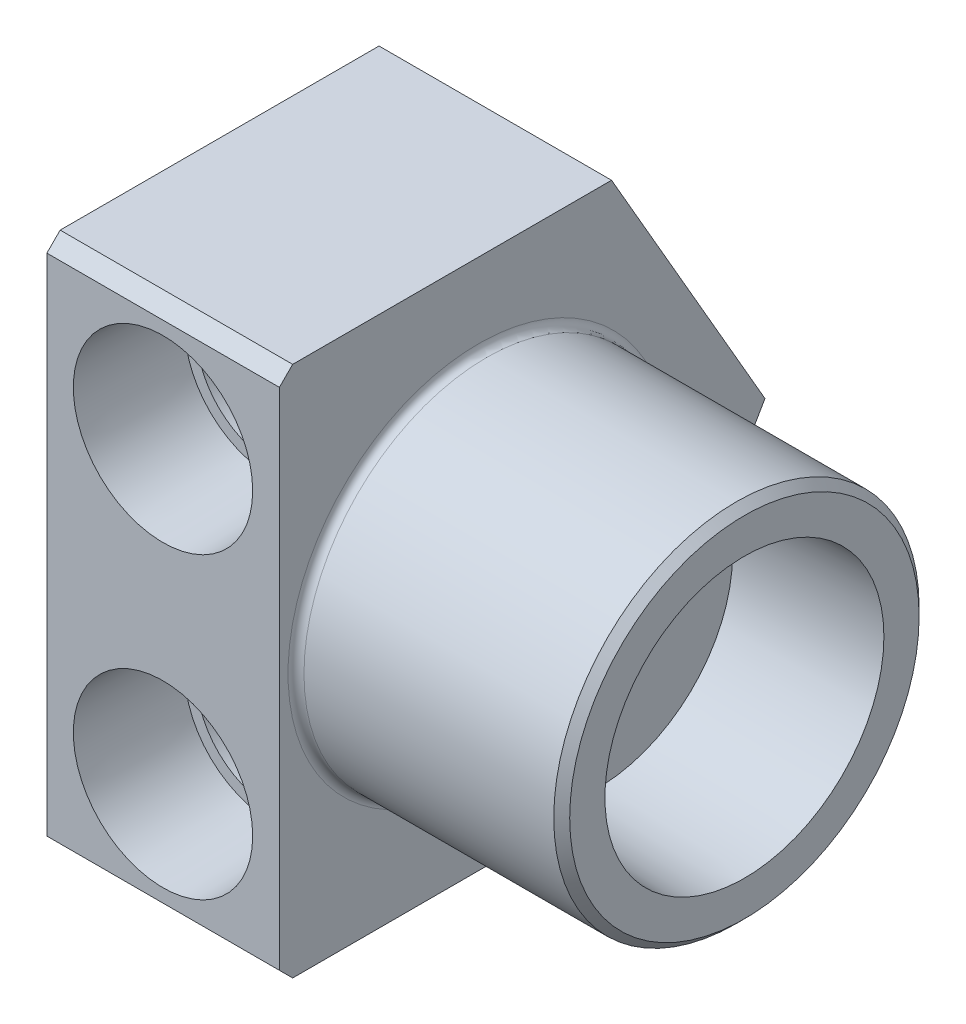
ISO-10303-21;
HEADER;
FILE_DESCRIPTION(('STEP AP214'),'2;1');
FILE_NAME('part.step','',(''),(''),'','','');
FILE_SCHEMA(('AUTOMOTIVE_DESIGN { 1 0 10303 214 1 1 1 1 }'));
ENDSEC;
DATA;
#1=APPLICATION_CONTEXT('core data for automotive mechanical design processes');
#2=APPLICATION_PROTOCOL_DEFINITION('international standard','automotive_design',2000,#1);
#3=PRODUCT_CONTEXT('',#1,'mechanical');
#4=PRODUCT('Part','Part','',(#3));
#5=PRODUCT_RELATED_PRODUCT_CATEGORY('part','',(#4));
#6=PRODUCT_DEFINITION_FORMATION('','',#4);
#7=PRODUCT_DEFINITION_CONTEXT('part definition',#1,'design');
#8=PRODUCT_DEFINITION('design','',#6,#7);
#9=PRODUCT_DEFINITION_SHAPE('','',#8);
#10=(LENGTH_UNIT() NAMED_UNIT(*) SI_UNIT(.MILLI.,.METRE.));
#11=(NAMED_UNIT(*) PLANE_ANGLE_UNIT() SI_UNIT($,.RADIAN.));
#12=(NAMED_UNIT(*) SI_UNIT($,.STERADIAN.) SOLID_ANGLE_UNIT());
#13=UNCERTAINTY_MEASURE_WITH_UNIT(LENGTH_MEASURE(1.E-05),#10,'distance_accuracy_value','');
#14=(GEOMETRIC_REPRESENTATION_CONTEXT(3) GLOBAL_UNCERTAINTY_ASSIGNED_CONTEXT((#13)) GLOBAL_UNIT_ASSIGNED_CONTEXT((#10,
#11,#12)) REPRESENTATION_CONTEXT('',''));
#15=CARTESIAN_POINT('',(0.,0.,0.));
#16=DIRECTION('',(0.,0.,1.));
#17=DIRECTION('',(1.,0.,0.));
#18=AXIS2_PLACEMENT_3D('',#15,#16,#17);
#19=CARTESIAN_POINT('',(33.5788,6.477,0.));
#20=DIRECTION('',(-1.,0.,0.));
#21=DIRECTION('',(0.,0.,1.));
#22=AXIS2_PLACEMENT_3D('',#19,#20,#21);
#23=PLANE('',#22);
#24=CARTESIAN_POINT('',(33.5788,0.,0.));
#25=DIRECTION('',(1.,0.,0.));
#26=DIRECTION('',(0.,0.,-1.));
#27=AXIS2_PLACEMENT_3D('',#24,#25,#26);
#28=CIRCLE('',#27,12.9142093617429);
#29=CARTESIAN_POINT('',(33.5788,0.,-12.9142093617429));
#30=VERTEX_POINT('',#29);
#31=EDGE_CURVE('E125',#30,#30,#28,.T.);
#32=ORIENTED_EDGE('',*,*,#31,.T.);
#33=EDGE_LOOP('',(#32));
#34=FACE_BOUND('',#33,.T.);
#35=CARTESIAN_POINT('',(33.5788,0.,0.));
#36=DIRECTION('',(1.,0.,0.));
#37=DIRECTION('',(0.,0.,-1.));
#38=AXIS2_PLACEMENT_3D('',#35,#36,#37);
#39=CIRCLE('',#38,6.54812);
#40=CARTESIAN_POINT('',(33.5788,0.,-6.54812));
#41=VERTEX_POINT('',#40);
#42=EDGE_CURVE('E94',#41,#41,#39,.T.);
#43=ORIENTED_EDGE('',*,*,#42,.F.);
#44=EDGE_LOOP('',(#43));
#45=FACE_BOUND('',#44,.T.);
#46=ADVANCED_FACE('F15',(#34,#45),#23,.F.);
#47=CARTESIAN_POINT('',(22.225,25.4,-12.7));
#48=DIRECTION('',(0.,-1.,0.));
#49=DIRECTION('',(0.,0.,-1.));
#50=AXIS2_PLACEMENT_3D('',#47,#48,#49);
#51=PLANE('',#50);
#52=DIRECTION('',(0.,0.,1.));
#53=VECTOR('',#52,1.);
#54=CARTESIAN_POINT('',(0.,25.4,-12.7));
#55=LINE('',#54,#53);
#56=CARTESIAN_POINT('',(0.,25.4,-12.7));
#57=VERTEX_POINT('',#56);
#58=CARTESIAN_POINT('',(0.,25.4,17.78));
#59=VERTEX_POINT('',#58);
#60=EDGE_CURVE('E128',#57,#59,#55,.T.);
#61=ORIENTED_EDGE('',*,*,#60,.T.);
#62=DIRECTION('',(1.,0.,0.));
#63=VECTOR('',#62,1.);
#64=CARTESIAN_POINT('',(22.225,25.4,17.78));
#65=LINE('',#64,#63);
#66=CARTESIAN_POINT('',(22.225,25.4,17.78));
#67=VERTEX_POINT('',#66);
#68=EDGE_CURVE('E10',#59,#67,#65,.T.);
#69=ORIENTED_EDGE('',*,*,#68,.T.);
#70=DIRECTION('',(0.,0.,1.));
#71=VECTOR('',#70,1.);
#72=CARTESIAN_POINT('',(22.225,25.4,-12.7));
#73=LINE('',#72,#71);
#74=CARTESIAN_POINT('',(22.225,25.4,-12.7));
#75=VERTEX_POINT('',#74);
#76=EDGE_CURVE('E129',#75,#67,#73,.T.);
#77=ORIENTED_EDGE('',*,*,#76,.F.);
#78=DIRECTION('',(-1.,0.,0.));
#79=VECTOR('',#78,1.);
#80=CARTESIAN_POINT('',(22.225,25.4,-12.7));
#81=LINE('',#80,#79);
#82=EDGE_CURVE('E140',#75,#57,#81,.T.);
#83=ORIENTED_EDGE('',*,*,#82,.T.);
#84=EDGE_LOOP('',(#61,#69,#77,#83));
#85=FACE_BOUND('',#84,.T.);
#86=ADVANCED_FACE('F203',(#85),#51,.F.);
#87=CARTESIAN_POINT('',(22.225,25.4,19.05));
#88=DIRECTION('',(0.,0.,-1.));
#89=DIRECTION('',(-1.,0.,0.));
#90=AXIS2_PLACEMENT_3D('',#87,#88,#89);
#91=PLANE('',#90);
#92=CARTESIAN_POINT('',(11.0998,14.2875,19.05));
#93=DIRECTION('',(0.,0.,1.));
#94=DIRECTION('',(1.,0.,0.));
#95=AXIS2_PLACEMENT_3D('',#92,#93,#94);
#96=CIRCLE('',#95,8.5727286);
#97=CARTESIAN_POINT('',(19.6725286,14.2875,19.05));
#98=VERTEX_POINT('',#97);
#99=EDGE_CURVE('E93',#98,#98,#96,.T.);
#100=ORIENTED_EDGE('',*,*,#99,.F.);
#101=EDGE_LOOP('',(#100));
#102=FACE_BOUND('',#101,.T.);
#103=CARTESIAN_POINT('',(11.0998,-14.2875,19.05));
#104=DIRECTION('',(0.,0.,1.));
#105=DIRECTION('',(1.,0.,0.));
#106=AXIS2_PLACEMENT_3D('',#103,#104,#105);
#107=CIRCLE('',#106,8.5727286);
#108=CARTESIAN_POINT('',(19.6725286,-14.2875,19.05));
#109=VERTEX_POINT('',#108);
#110=EDGE_CURVE('E110',#109,#109,#107,.T.);
#111=ORIENTED_EDGE('',*,*,#110,.F.);
#112=EDGE_LOOP('',(#111));
#113=FACE_BOUND('',#112,.T.);
#114=DIRECTION('',(0.,-1.,0.));
#115=VECTOR('',#114,1.);
#116=CARTESIAN_POINT('',(0.,25.4,19.05));
#117=LINE('',#116,#115);
#118=CARTESIAN_POINT('',(0.,24.13,19.05));
#119=VERTEX_POINT('',#118);
#120=CARTESIAN_POINT('',(0.,-24.13,19.05));
#121=VERTEX_POINT('',#120);
#122=EDGE_CURVE('E142',#119,#121,#117,.T.);
#123=ORIENTED_EDGE('',*,*,#122,.T.);
#124=DIRECTION('',(1.,0.,0.));
#125=VECTOR('',#124,1.);
#126=CARTESIAN_POINT('',(22.225,-24.13,19.05));
#127=LINE('',#126,#125);
#128=CARTESIAN_POINT('',(22.225,-24.13,19.05));
#129=VERTEX_POINT('',#128);
#130=EDGE_CURVE('E36',#121,#129,#127,.T.);
#131=ORIENTED_EDGE('',*,*,#130,.T.);
#132=DIRECTION('',(0.,-1.,0.));
#133=VECTOR('',#132,1.);
#134=CARTESIAN_POINT('',(22.225,25.4,19.05));
#135=LINE('',#134,#133);
#136=CARTESIAN_POINT('',(22.225,24.13,19.05));
#137=VERTEX_POINT('',#136);
#138=EDGE_CURVE('E131',#137,#129,#135,.T.);
#139=ORIENTED_EDGE('',*,*,#138,.F.);
#140=DIRECTION('',(-1.,0.,0.));
#141=VECTOR('',#140,1.);
#142=CARTESIAN_POINT('',(22.225,24.13,19.05));
#143=LINE('',#142,#141);
#144=EDGE_CURVE('E176',#137,#119,#143,.T.);
#145=ORIENTED_EDGE('',*,*,#144,.T.);
#146=EDGE_LOOP('',(#123,#131,#139,#145));
#147=FACE_BOUND('',#146,.T.);
#148=ADVANCED_FACE('F197',(#102,#113,#147),#91,.F.);
#149=CARTESIAN_POINT('',(22.225,-25.4,19.05));
#150=DIRECTION('',(0.,1.,0.));
#151=DIRECTION('',(0.,0.,1.));
#152=AXIS2_PLACEMENT_3D('',#149,#150,#151);
#153=PLANE('',#152);
#154=DIRECTION('',(0.,0.,-1.));
#155=VECTOR('',#154,1.);
#156=CARTESIAN_POINT('',(22.225,-25.4,19.05));
#157=LINE('',#156,#155);
#158=CARTESIAN_POINT('',(22.225,-25.4,17.78));
#159=VERTEX_POINT('',#158);
#160=CARTESIAN_POINT('',(22.225,-25.4,-12.7));
#161=VERTEX_POINT('',#160);
#162=EDGE_CURVE('E134',#159,#161,#157,.T.);
#163=ORIENTED_EDGE('',*,*,#162,.F.);
#164=DIRECTION('',(-1.,0.,0.));
#165=VECTOR('',#164,1.);
#166=CARTESIAN_POINT('',(22.225,-25.4,17.78));
#167=LINE('',#166,#165);
#168=CARTESIAN_POINT('',(0.,-25.4,17.78));
#169=VERTEX_POINT('',#168);
#170=EDGE_CURVE('E169',#159,#169,#167,.T.);
#171=ORIENTED_EDGE('',*,*,#170,.T.);
#172=DIRECTION('',(0.,0.,-1.));
#173=VECTOR('',#172,1.);
#174=CARTESIAN_POINT('',(0.,-25.4,19.05));
#175=LINE('',#174,#173);
#176=CARTESIAN_POINT('',(0.,-25.4,-12.7));
#177=VERTEX_POINT('',#176);
#178=EDGE_CURVE('E144',#169,#177,#175,.T.);
#179=ORIENTED_EDGE('',*,*,#178,.T.);
#180=DIRECTION('',(-1.,0.,0.));
#181=VECTOR('',#180,1.);
#182=CARTESIAN_POINT('',(22.225,-25.4,-12.7));
#183=LINE('',#182,#181);
#184=EDGE_CURVE('E154',#161,#177,#183,.T.);
#185=ORIENTED_EDGE('',*,*,#184,.F.);
#186=EDGE_LOOP('',(#163,#171,#179,#185));
#187=FACE_BOUND('',#186,.T.);
#188=ADVANCED_FACE('F189',(#187),#153,.F.);
#189=CARTESIAN_POINT('',(22.225,-25.4,-12.7));
#190=DIRECTION('',(0.,0.5,0.866025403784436));
#191=DIRECTION('',(0.,-0.866025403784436,0.5));
#192=AXIS2_PLACEMENT_3D('',#189,#190,#191);
#193=PLANE('',#192);
#194=DIRECTION('',(0.,0.866025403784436,-0.5));
#195=VECTOR('',#194,1.);
#196=CARTESIAN_POINT('',(0.,-25.4,-12.7));
#197=LINE('',#196,#195);
#198=CARTESIAN_POINT('',(0.,0.,-27.3646968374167));
#199=VERTEX_POINT('',#198);
#200=EDGE_CURVE('E146',#177,#199,#197,.T.);
#201=ORIENTED_EDGE('',*,*,#200,.T.);
#202=DIRECTION('',(-1.,0.,0.));
#203=VECTOR('',#202,1.);
#204=CARTESIAN_POINT('',(22.225,0.,-27.3646968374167));
#205=LINE('',#204,#203);
#206=CARTESIAN_POINT('',(22.225,0.,-27.3646968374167));
#207=VERTEX_POINT('',#206);
#208=EDGE_CURVE('E151',#207,#199,#205,.T.);
#209=ORIENTED_EDGE('',*,*,#208,.F.);
#210=DIRECTION('',(0.,0.866025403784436,-0.5));
#211=VECTOR('',#210,1.);
#212=CARTESIAN_POINT('',(22.225,-25.4,-12.7));
#213=LINE('',#212,#211);
#214=EDGE_CURVE('E136',#161,#207,#213,.T.);
#215=ORIENTED_EDGE('',*,*,#214,.F.);
#216=ORIENTED_EDGE('',*,*,#184,.T.);
#217=EDGE_LOOP('',(#201,#209,#215,#216));
#218=FACE_BOUND('',#217,.T.);
#219=ADVANCED_FACE('F210',(#218),#193,.F.);
#220=CARTESIAN_POINT('',(22.225,0.,-27.3646968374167));
#221=DIRECTION('',(0.,-0.5,0.866025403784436));
#222=DIRECTION('',(0.,-0.866025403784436,-0.5));
#223=AXIS2_PLACEMENT_3D('',#220,#221,#222);
#224=PLANE('',#223);
#225=DIRECTION('',(0.,0.866025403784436,0.5));
#226=VECTOR('',#225,1.);
#227=CARTESIAN_POINT('',(0.,0.,-27.3646968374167));
#228=LINE('',#227,#226);
#229=EDGE_CURVE('E132',#199,#57,#228,.T.);
#230=ORIENTED_EDGE('',*,*,#229,.T.);
#231=ORIENTED_EDGE('',*,*,#82,.F.);
#232=DIRECTION('',(0.,0.866025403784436,0.5));
#233=VECTOR('',#232,1.);
#234=CARTESIAN_POINT('',(22.225,0.,-27.3646968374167));
#235=LINE('',#234,#233);
#236=EDGE_CURVE('E138',#207,#75,#235,.T.);
#237=ORIENTED_EDGE('',*,*,#236,.F.);
#238=ORIENTED_EDGE('',*,*,#208,.T.);
#239=EDGE_LOOP('',(#230,#231,#237,#238));
#240=FACE_BOUND('',#239,.T.);
#241=ADVANCED_FACE('F207',(#240),#224,.F.);
#242=CARTESIAN_POINT('',(22.225,0.,0.));
#243=DIRECTION('',(1.,0.,0.));
#244=DIRECTION('',(0.,0.,-1.));
#245=AXIS2_PLACEMENT_3D('',#242,#243,#244);
#246=PLANE('',#245);
#247=CARTESIAN_POINT('',(22.225,0.,0.));
#248=DIRECTION('',(1.,0.,0.));
#249=DIRECTION('',(0.,0.,-1.));
#250=AXIS2_PLACEMENT_3D('',#247,#248,#249);
#251=CIRCLE('',#250,18.2245);
#252=CARTESIAN_POINT('',(22.225,0.,-18.2245));
#253=VERTEX_POINT('',#252);
#254=EDGE_CURVE('E166',#253,#253,#251,.F.);
#255=ORIENTED_EDGE('',*,*,#254,.T.);
#256=EDGE_LOOP('',(#255));
#257=FACE_BOUND('',#256,.T.);
#258=ORIENTED_EDGE('',*,*,#138,.T.);
#259=DIRECTION('',(0.,0.70710678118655,0.707106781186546));
#260=VECTOR('',#259,1.);
#261=CARTESIAN_POINT('',(22.225,-21.59,21.59));
#262=LINE('',#261,#260);
#263=EDGE_CURVE('E23',#129,#159,#262,.F.);
#264=ORIENTED_EDGE('',*,*,#263,.T.);
#265=ORIENTED_EDGE('',*,*,#162,.T.);
#266=ORIENTED_EDGE('',*,*,#214,.T.);
#267=ORIENTED_EDGE('',*,*,#236,.T.);
#268=ORIENTED_EDGE('',*,*,#76,.T.);
#269=DIRECTION('',(0.,0.707106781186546,-0.70710678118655));
#270=VECTOR('',#269,1.);
#271=CARTESIAN_POINT('',(22.225,21.59,21.59));
#272=LINE('',#271,#270);
#273=EDGE_CURVE('E180',#67,#137,#272,.F.);
#274=ORIENTED_EDGE('',*,*,#273,.T.);
#275=EDGE_LOOP('',(#258,#264,#265,#266,#267,#268,#274));
#276=FACE_BOUND('',#275,.T.);
#277=ADVANCED_FACE('F184',(#257,#276),#246,.T.);
#278=CARTESIAN_POINT('',(0.,0.,0.));
#279=DIRECTION('',(1.,0.,0.));
#280=DIRECTION('',(0.,0.,-1.));
#281=AXIS2_PLACEMENT_3D('',#278,#279,#280);
#282=PLANE('',#281);
#283=ORIENTED_EDGE('',*,*,#178,.F.);
#284=DIRECTION('',(0.,-0.70710678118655,-0.707106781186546));
#285=VECTOR('',#284,1.);
#286=CARTESIAN_POINT('',(0.,-25.4,17.78));
#287=LINE('',#286,#285);
#288=EDGE_CURVE('E174',#169,#121,#287,.F.);
#289=ORIENTED_EDGE('',*,*,#288,.T.);
#290=ORIENTED_EDGE('',*,*,#122,.F.);
#291=DIRECTION('',(0.,-0.707106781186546,0.70710678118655));
#292=VECTOR('',#291,1.);
#293=CARTESIAN_POINT('',(0.,24.13,19.05));
#294=LINE('',#293,#292);
#295=EDGE_CURVE('E172',#119,#59,#294,.F.);
#296=ORIENTED_EDGE('',*,*,#295,.T.);
#297=ORIENTED_EDGE('',*,*,#60,.F.);
#298=ORIENTED_EDGE('',*,*,#229,.F.);
#299=ORIENTED_EDGE('',*,*,#200,.F.);
#300=EDGE_LOOP('',(#283,#289,#290,#296,#297,#298,#299));
#301=FACE_BOUND('',#300,.T.);
#302=ADVANCED_FACE('F195',(#301),#282,.F.);
#303=CARTESIAN_POINT('',(47.625,0.,0.));
#304=DIRECTION('',(-1.,0.,0.));
#305=DIRECTION('',(0.,0.,1.));
#306=AXIS2_PLACEMENT_3D('',#303,#304,#305);
#307=CYLINDRICAL_SURFACE('',#306,17.4625);
#308=CARTESIAN_POINT('',(22.987,0.,0.));
#309=DIRECTION('',(1.,0.,0.));
#310=DIRECTION('',(0.,0.,-1.));
#311=AXIS2_PLACEMENT_3D('',#308,#309,#310);
#312=CIRCLE('',#311,17.4625);
#313=CARTESIAN_POINT('',(22.987,0.,-17.4625));
#314=VERTEX_POINT('',#313);
#315=EDGE_CURVE('E163',#314,#314,#312,.T.);
#316=ORIENTED_EDGE('',*,*,#315,.T.);
#317=EDGE_LOOP('',(#316));
#318=FACE_BOUND('',#317,.T.);
#319=CARTESIAN_POINT('',(46.863,0.,0.));
#320=DIRECTION('',(1.,0.,0.));
#321=DIRECTION('',(0.,0.,-1.));
#322=AXIS2_PLACEMENT_3D('',#319,#320,#321);
#323=CIRCLE('',#322,17.4625);
#324=CARTESIAN_POINT('',(46.863,0.,-17.4625));
#325=VERTEX_POINT('',#324);
#326=EDGE_CURVE('E160',#325,#325,#323,.F.);
#327=ORIENTED_EDGE('',*,*,#326,.T.);
#328=EDGE_LOOP('',(#327));
#329=FACE_BOUND('',#328,.T.);
#330=ADVANCED_FACE('F237',(#318,#329),#307,.T.);
#331=CARTESIAN_POINT('',(47.625,0.,0.));
#332=DIRECTION('',(1.,0.,0.));
#333=DIRECTION('',(0.,0.,-1.));
#334=AXIS2_PLACEMENT_3D('',#331,#332,#333);
#335=PLANE('',#334);
#336=CARTESIAN_POINT('',(47.625,0.,0.));
#337=DIRECTION('',(1.,0.,0.));
#338=DIRECTION('',(0.,0.,-1.));
#339=AXIS2_PLACEMENT_3D('',#336,#337,#338);
#340=CIRCLE('',#339,16.7005);
#341=CARTESIAN_POINT('',(47.625,0.,-16.7005));
#342=VERTEX_POINT('',#341);
#343=EDGE_CURVE('E157',#342,#342,#340,.T.);
#344=ORIENTED_EDGE('',*,*,#343,.T.);
#345=EDGE_LOOP('',(#344));
#346=FACE_BOUND('',#345,.T.);
#347=CARTESIAN_POINT('',(47.625,0.,0.));
#348=DIRECTION('',(1.,0.,0.));
#349=DIRECTION('',(0.,0.,-1.));
#350=AXIS2_PLACEMENT_3D('',#347,#348,#349);
#351=CIRCLE('',#350,13.3347714);
#352=CARTESIAN_POINT('',(47.625,0.,-13.3347714));
#353=VERTEX_POINT('',#352);
#354=EDGE_CURVE('E122',#353,#353,#351,.T.);
#355=ORIENTED_EDGE('',*,*,#354,.F.);
#356=EDGE_LOOP('',(#355));
#357=FACE_BOUND('',#356,.T.);
#358=ADVANCED_FACE('F234',(#346,#357),#335,.T.);
#359=CARTESIAN_POINT('',(47.625,0.,0.));
#360=DIRECTION('',(1.,0.,0.));
#361=DIRECTION('',(0.,0.,-1.));
#362=AXIS2_PLACEMENT_3D('',#359,#360,#361);
#363=CONICAL_SURFACE('',#362,13.3347714,0.0299323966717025);
#364=ORIENTED_EDGE('',*,*,#31,.F.);
#365=EDGE_LOOP('',(#364));
#366=FACE_BOUND('',#365,.T.);
#367=ORIENTED_EDGE('',*,*,#354,.T.);
#368=EDGE_LOOP('',(#367));
#369=FACE_BOUND('',#368,.T.);
#370=ADVANCED_FACE('F232',(#366,#369),#363,.F.);
#371=CARTESIAN_POINT('',(11.0998,-14.2875,-11.049));
#372=DIRECTION('',(0.,0.,1.));
#373=DIRECTION('',(1.,0.,0.));
#374=AXIS2_PLACEMENT_3D('',#371,#372,#373);
#375=CONICAL_SURFACE('',#374,7.1374,1.02974425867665);
#376=CARTESIAN_POINT('',(11.0998,-14.2875,-15.3375825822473));
#377=VERTEX_POINT('',#376);
#378=VERTEX_LOOP('',#377);
#379=FACE_BOUND('',#378,.T.);
#380=CARTESIAN_POINT('',(11.0998,-14.2875,-11.049));
#381=DIRECTION('',(0.,0.,1.));
#382=DIRECTION('',(1.,0.,0.));
#383=AXIS2_PLACEMENT_3D('',#380,#381,#382);
#384=CIRCLE('',#383,7.1374);
#385=CARTESIAN_POINT('',(18.2372,-14.2875,-11.049));
#386=VERTEX_POINT('',#385);
#387=EDGE_CURVE('E119',#386,#386,#384,.T.);
#388=ORIENTED_EDGE('',*,*,#387,.T.);
#389=EDGE_LOOP('',(#388));
#390=FACE_BOUND('',#389,.T.);
#391=ADVANCED_FACE('F273',(#379,#390),#375,.F.);
#392=CARTESIAN_POINT('',(11.0998,-14.2875,19.05));
#393=DIRECTION('',(0.,0.,1.));
#394=DIRECTION('',(1.,0.,0.));
#395=AXIS2_PLACEMENT_3D('',#392,#393,#394);
#396=CYLINDRICAL_SURFACE('',#395,7.1374);
#397=ORIENTED_EDGE('',*,*,#387,.F.);
#398=EDGE_LOOP('',(#397));
#399=FACE_BOUND('',#398,.T.);
#400=CARTESIAN_POINT('',(11.0998,-14.2875,8.7122));
#401=DIRECTION('',(0.,0.,1.));
#402=DIRECTION('',(1.,0.,0.));
#403=AXIS2_PLACEMENT_3D('',#400,#401,#402);
#404=CIRCLE('',#403,7.1374);
#405=CARTESIAN_POINT('',(18.2372,-14.2875,8.7122));
#406=VERTEX_POINT('',#405);
#407=EDGE_CURVE('E116',#406,#406,#404,.T.);
#408=ORIENTED_EDGE('',*,*,#407,.T.);
#409=EDGE_LOOP('',(#408));
#410=FACE_BOUND('',#409,.T.);
#411=ADVANCED_FACE('F281',(#399,#410),#396,.F.);
#412=CARTESIAN_POINT('',(18.2372,-14.2875,8.7122));
#413=DIRECTION('',(0.,0.,-1.));
#414=DIRECTION('',(-1.,0.,0.));
#415=AXIS2_PLACEMENT_3D('',#412,#413,#414);
#416=PLANE('',#415);
#417=ORIENTED_EDGE('',*,*,#407,.F.);
#418=EDGE_LOOP('',(#417));
#419=FACE_BOUND('',#418,.T.);
#420=CARTESIAN_POINT('',(11.0998,-14.2875,8.7122));
#421=DIRECTION('',(0.,0.,1.));
#422=DIRECTION('',(1.,0.,0.));
#423=AXIS2_PLACEMENT_3D('',#420,#421,#422);
#424=CIRCLE('',#423,8.26320102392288);
#425=CARTESIAN_POINT('',(19.3630010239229,-14.2875,8.7122));
#426=VERTEX_POINT('',#425);
#427=EDGE_CURVE('E113',#426,#426,#424,.T.);
#428=ORIENTED_EDGE('',*,*,#427,.T.);
#429=EDGE_LOOP('',(#428));
#430=FACE_BOUND('',#429,.T.);
#431=ADVANCED_FACE('F289',(#419,#430),#416,.F.);
#432=CARTESIAN_POINT('',(11.0998,-14.2875,19.05));
#433=DIRECTION('',(0.,0.,1.));
#434=DIRECTION('',(1.,0.,0.));
#435=AXIS2_PLACEMENT_3D('',#432,#433,#434);
#436=CONICAL_SURFACE('',#435,8.5727286,0.0299323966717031);
#437=ORIENTED_EDGE('',*,*,#427,.F.);
#438=EDGE_LOOP('',(#437));
#439=FACE_BOUND('',#438,.T.);
#440=ORIENTED_EDGE('',*,*,#110,.T.);
#441=EDGE_LOOP('',(#440));
#442=FACE_BOUND('',#441,.T.);
#443=ADVANCED_FACE('F298',(#439,#442),#436,.F.);
#444=CARTESIAN_POINT('',(11.0998,14.2875,-11.049));
#445=DIRECTION('',(0.,0.,1.));
#446=DIRECTION('',(1.,0.,0.));
#447=AXIS2_PLACEMENT_3D('',#444,#445,#446);
#448=CONICAL_SURFACE('',#447,7.1374,1.02974425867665);
#449=CARTESIAN_POINT('',(11.0998,14.2875,-15.3375825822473));
#450=VERTEX_POINT('',#449);
#451=VERTEX_LOOP('',#450);
#452=FACE_BOUND('',#451,.T.);
#453=CARTESIAN_POINT('',(11.0998,14.2875,-11.049));
#454=DIRECTION('',(0.,0.,1.));
#455=DIRECTION('',(1.,0.,0.));
#456=AXIS2_PLACEMENT_3D('',#453,#454,#455);
#457=CIRCLE('',#456,7.1374);
#458=CARTESIAN_POINT('',(18.2372,14.2875,-11.049));
#459=VERTEX_POINT('',#458);
#460=EDGE_CURVE('E107',#459,#459,#457,.T.);
#461=ORIENTED_EDGE('',*,*,#460,.T.);
#462=EDGE_LOOP('',(#461));
#463=FACE_BOUND('',#462,.T.);
#464=ADVANCED_FACE('F307',(#452,#463),#448,.F.);
#465=CARTESIAN_POINT('',(11.0998,14.2875,19.05));
#466=DIRECTION('',(0.,0.,1.));
#467=DIRECTION('',(1.,0.,0.));
#468=AXIS2_PLACEMENT_3D('',#465,#466,#467);
#469=CYLINDRICAL_SURFACE('',#468,7.1374);
#470=ORIENTED_EDGE('',*,*,#460,.F.);
#471=EDGE_LOOP('',(#470));
#472=FACE_BOUND('',#471,.T.);
#473=CARTESIAN_POINT('',(11.0998,14.2875,8.7122));
#474=DIRECTION('',(0.,0.,1.));
#475=DIRECTION('',(1.,0.,0.));
#476=AXIS2_PLACEMENT_3D('',#473,#474,#475);
#477=CIRCLE('',#476,7.1374);
#478=CARTESIAN_POINT('',(18.2372,14.2875,8.7122));
#479=VERTEX_POINT('',#478);
#480=EDGE_CURVE('E104',#479,#479,#477,.T.);
#481=ORIENTED_EDGE('',*,*,#480,.T.);
#482=EDGE_LOOP('',(#481));
#483=FACE_BOUND('',#482,.T.);
#484=ADVANCED_FACE('F316',(#472,#483),#469,.F.);
#485=CARTESIAN_POINT('',(18.2372,14.2875,8.7122));
#486=DIRECTION('',(0.,0.,-1.));
#487=DIRECTION('',(-1.,0.,0.));
#488=AXIS2_PLACEMENT_3D('',#485,#486,#487);
#489=PLANE('',#488);
#490=ORIENTED_EDGE('',*,*,#480,.F.);
#491=EDGE_LOOP('',(#490));
#492=FACE_BOUND('',#491,.T.);
#493=CARTESIAN_POINT('',(11.0998,14.2875,8.7122));
#494=DIRECTION('',(0.,0.,1.));
#495=DIRECTION('',(1.,0.,0.));
#496=AXIS2_PLACEMENT_3D('',#493,#494,#495);
#497=CIRCLE('',#496,8.26320102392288);
#498=CARTESIAN_POINT('',(19.3630010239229,14.2875,8.7122));
#499=VERTEX_POINT('',#498);
#500=EDGE_CURVE('E97',#499,#499,#497,.T.);
#501=ORIENTED_EDGE('',*,*,#500,.T.);
#502=EDGE_LOOP('',(#501));
#503=FACE_BOUND('',#502,.T.);
#504=ADVANCED_FACE('F325',(#492,#503),#489,.F.);
#505=CARTESIAN_POINT('',(11.0998,14.2875,19.05));
#506=DIRECTION('',(0.,0.,1.));
#507=DIRECTION('',(1.,0.,0.));
#508=AXIS2_PLACEMENT_3D('',#505,#506,#507);
#509=CONICAL_SURFACE('',#508,8.5727286,0.0299323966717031);
#510=ORIENTED_EDGE('',*,*,#500,.F.);
#511=EDGE_LOOP('',(#510));
#512=FACE_BOUND('',#511,.T.);
#513=ORIENTED_EDGE('',*,*,#99,.T.);
#514=EDGE_LOOP('',(#513));
#515=FACE_BOUND('',#514,.T.);
#516=ADVANCED_FACE('F87',(#512,#515),#509,.F.);
#517=CARTESIAN_POINT('',(7.112,0.,0.));
#518=DIRECTION('',(1.,0.,0.));
#519=DIRECTION('',(0.,0.,-1.));
#520=AXIS2_PLACEMENT_3D('',#517,#518,#519);
#521=CONICAL_SURFACE('',#520,6.54812,1.02974425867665);
#522=CARTESIAN_POINT('',(3.17749256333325,0.,0.));
#523=VERTEX_POINT('',#522);
#524=VERTEX_LOOP('',#523);
#525=FACE_BOUND('',#524,.T.);
#526=CARTESIAN_POINT('',(7.112,0.,0.));
#527=DIRECTION('',(1.,0.,0.));
#528=DIRECTION('',(0.,0.,-1.));
#529=AXIS2_PLACEMENT_3D('',#526,#527,#528);
#530=CIRCLE('',#529,6.54812);
#531=CARTESIAN_POINT('',(7.112,0.,-6.54812));
#532=VERTEX_POINT('',#531);
#533=EDGE_CURVE('E91',#532,#532,#530,.T.);
#534=ORIENTED_EDGE('',*,*,#533,.T.);
#535=EDGE_LOOP('',(#534));
#536=FACE_BOUND('',#535,.T.);
#537=ADVANCED_FACE('F83',(#525,#536),#521,.F.);
#538=CARTESIAN_POINT('',(33.5788,0.,0.));
#539=DIRECTION('',(1.,0.,0.));
#540=DIRECTION('',(0.,0.,-1.));
#541=AXIS2_PLACEMENT_3D('',#538,#539,#540);
#542=CYLINDRICAL_SURFACE('',#541,6.54812);
#543=ORIENTED_EDGE('',*,*,#533,.F.);
#544=EDGE_LOOP('',(#543));
#545=FACE_BOUND('',#544,.T.);
#546=ORIENTED_EDGE('',*,*,#42,.T.);
#547=EDGE_LOOP('',(#546));
#548=FACE_BOUND('',#547,.T.);
#549=ADVANCED_FACE('F86',(#545,#548),#542,.F.);
#550=CARTESIAN_POINT('',(47.625,0.,0.));
#551=DIRECTION('',(-1.,0.,0.));
#552=DIRECTION('',(0.,0.,1.));
#553=AXIS2_PLACEMENT_3D('',#550,#551,#552);
#554=CONICAL_SURFACE('',#553,16.7005,0.785398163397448);
#555=ORIENTED_EDGE('',*,*,#326,.F.);
#556=EDGE_LOOP('',(#555));
#557=FACE_BOUND('',#556,.T.);
#558=ORIENTED_EDGE('',*,*,#343,.F.);
#559=EDGE_LOOP('',(#558));
#560=FACE_BOUND('',#559,.T.);
#561=ADVANCED_FACE('F355',(#557,#560),#554,.T.);
#562=CARTESIAN_POINT('',(22.987,0.,0.));
#563=DIRECTION('',(1.,0.,0.));
#564=DIRECTION('',(0.,0.,-1.));
#565=AXIS2_PLACEMENT_3D('',#562,#563,#564);
#566=TOROIDAL_SURFACE('',#565,18.2245,0.762);
#567=ORIENTED_EDGE('',*,*,#254,.F.);
#568=EDGE_LOOP('',(#567));
#569=FACE_BOUND('',#568,.T.);
#570=ORIENTED_EDGE('',*,*,#315,.F.);
#571=EDGE_LOOP('',(#570));
#572=FACE_BOUND('',#571,.T.);
#573=ADVANCED_FACE('F363',(#569,#572),#566,.F.);
#574=CARTESIAN_POINT('',(22.225,-25.4,17.78));
#575=DIRECTION('',(0.,0.707106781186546,-0.70710678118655));
#576=DIRECTION('',(-1.,0.,0.));
#577=AXIS2_PLACEMENT_3D('',#574,#575,#576);
#578=PLANE('',#577);
#579=ORIENTED_EDGE('',*,*,#263,.F.);
#580=ORIENTED_EDGE('',*,*,#130,.F.);
#581=ORIENTED_EDGE('',*,*,#288,.F.);
#582=ORIENTED_EDGE('',*,*,#170,.F.);
#583=EDGE_LOOP('',(#579,#580,#581,#582));
#584=FACE_BOUND('',#583,.T.);
#585=ADVANCED_FACE('F192',(#584),#578,.F.);
#586=CARTESIAN_POINT('',(22.225,24.13,19.05));
#587=DIRECTION('',(0.,-0.70710678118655,-0.707106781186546));
#588=DIRECTION('',(-1.,0.,0.));
#589=AXIS2_PLACEMENT_3D('',#586,#587,#588);
#590=PLANE('',#589);
#591=ORIENTED_EDGE('',*,*,#273,.F.);
#592=ORIENTED_EDGE('',*,*,#68,.F.);
#593=ORIENTED_EDGE('',*,*,#295,.F.);
#594=ORIENTED_EDGE('',*,*,#144,.F.);
#595=EDGE_LOOP('',(#591,#592,#593,#594));
#596=FACE_BOUND('',#595,.T.);
#597=ADVANCED_FACE('F17',(#596),#590,.F.);
#598=CLOSED_SHELL('',(#46,#86,#148,#188,#219,#241,#277,#302,#330,#358,#370,#391,#411,#431,#443,
#464,#484,#504,#516,#537,#549,#561,#573,#585,#597));
#599=MANIFOLD_SOLID_BREP('B1',#598);
#600=ADVANCED_BREP_SHAPE_REPRESENTATION('',(#18,#599),#14);
#601=SHAPE_DEFINITION_REPRESENTATION(#9,#600);
ENDSEC;
END-ISO-10303-21;
